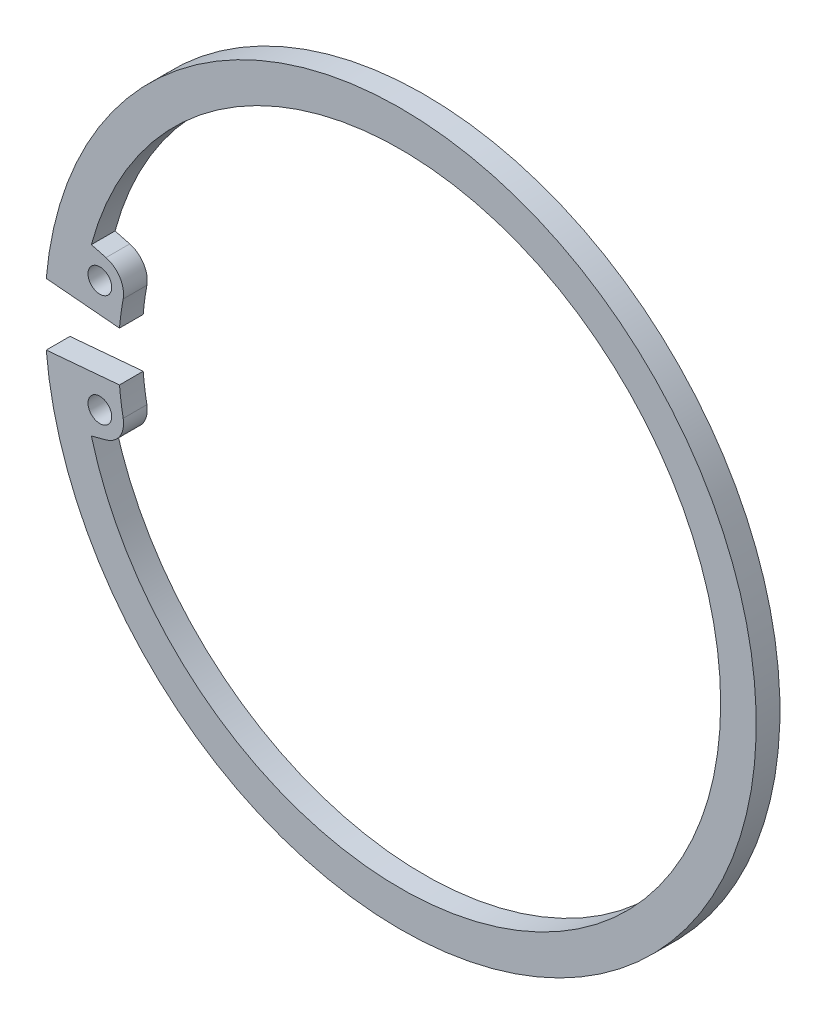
from build123d import *

# Parameters (mm, degrees)
ESQUISSE1_R          = 0.5
BASE_EXTRUSION_DEPTH = 1


with BuildPart() as part:
    # Esquisse1 → Base-Extrusion (new body)
    with BuildSketch(Plane.XY):
        with BuildLine():
            Line((-13.039998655, 3.494057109), (-12.422947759, 3.32871882))
            ThreePointArc((-12.422947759, 3.32871882), (-11.835787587, 2.896008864), (-11.698684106, 2.179630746))
            ThreePointArc((-11.698684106, 2.179630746), (-11.790546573, 1.610283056), (-11.854716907, 1.037153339))
            Line((-11.854716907, 1.037153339), (-14.942920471, 1.307336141))
            ThreePointArc((-14.942920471, 1.307336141), (14.942920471, 1.307336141), (-14.488887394, -3.882285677))
            ThreePointArc((-14.488887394, -3.882285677), (-14.772116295, -2.604722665), (-14.942920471, -1.307336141))
            Line((-14.942920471, -1.307336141), (-11.854716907, -1.037153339))
            ThreePointArc((-11.854716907, -1.037153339), (-11.790546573, -1.610283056), (-11.698684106, -2.179630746))
            ThreePointArc((-11.698684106, -2.179630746), (-11.835787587, -2.896008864), (-12.422947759, -3.32871882))
            Line((-12.422947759, -3.32871882), (-13.039998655, -3.494057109))
            ThreePointArc((-13.039998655, -3.494057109), (13.5, 0), (-13.039998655, 3.494057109))
        make_face()
        with Locations((-12.681766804, 2.362792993)):
            Circle(ESQUISSE1_R, mode=Mode.SUBTRACT)
        with Locations(Location((-12.681766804, -2.362792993, 0), (0, 0, 180))):
            Circle(ESQUISSE1_R, mode=Mode.SUBTRACT)
    extrude(amount=BASE_EXTRUSION_DEPTH)


solid = part.part
